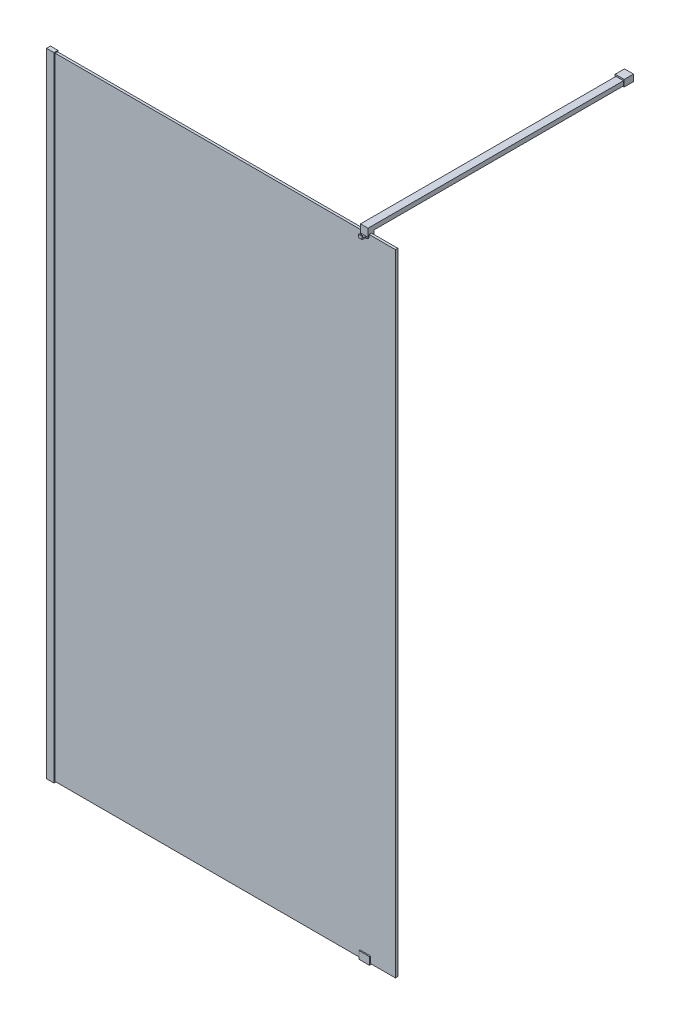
from build123d import *

# Parameters (mm, degrees)
DODANIE_WYCI_GNI_CIE1_DEPTH     = 2100
SZKIC2_W                        = 1147
SZKIC2_H                        = 8
DODANIE_WYCI_GNI_CIE2_DEPTH     = 2100
SZKIC4_W                        = 25
SZKIC4_H                        = 13.3
DODANIE_WYCI_GNI_CIE3_DEPTH     = 3
SZKIC5_W                        = 25
SZKIC5_H                        = 13.3
DODANIE_WYCI_GNI_CIE4_DEPTH     = 3
DODANIE_WYCI_GNI_CIE5_DEPTH     = 17.5
DODANIE_WYCI_GNI_CIE6_DEPTH     = 12.5
WYTNIJ_WYCI_GNI_CIE1_DEPTH      = 2402.039725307
WYTNIJ_WYCI_GNI_CIE1_DEPTH_BACK = 2402.039725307
SZKIC10_W                       = 25
SZKIC10_H                       = 861.63
DODANIE_WYCI_GNI_CIE7_DEPTH     = 15
SZKIC14_W                       = 30
SZKIC14_H                       = 22
DODANIE_WYCI_GNI_CIE8_DEPTH     = 31


with BuildPart() as part:
    # Szkic1 → Dodanie-wyci_gni_cie1 (new body)
    with BuildSketch(Plane(origin=(0, 0, 0), x_dir=(1, 0, 0), z_dir=(0, 1, 0))):
        Polygon((0, 0), (0, 13.3), (25, 13.3), (25, 11.4), (11.45, 11.4), (11.45, 3.4), (25, 3.4), (25, 0), align=None)
    extrude(amount=DODANIE_WYCI_GNI_CIE1_DEPTH)

    # Szkic4 → Dodanie-wyci_gni_cie3 (add)
    with BuildSketch(Plane(origin=(0, 2100, 0), x_dir=(1, 0, 0), z_dir=(0, 1, 0))):
        with Locations((12.5, 6.65)):
            Rectangle(SZKIC4_W, SZKIC4_H)
    extrude(amount=DODANIE_WYCI_GNI_CIE3_DEPTH)

    # Szkic5 → Dodanie-wyci_gni_cie4 (add)
    with BuildSketch(Plane.XZ):
        with Locations((12.5, -6.65)):
            Rectangle(SZKIC5_W, SZKIC5_H)
    extrude(amount=DODANIE_WYCI_GNI_CIE4_DEPTH)


with BuildPart() as body_2:
    # Szkic2 → Dodanie-wyci_gni_cie2 (new body)
    with BuildSketch(Plane.XZ):
        with Locations((584.95, -7.4)):
            Rectangle(SZKIC2_W, SZKIC2_H)
    extrude(amount=-DODANIE_WYCI_GNI_CIE2_DEPTH)


with BuildPart() as body_3:
    # Szkic6 → Dodanie-wyci_gni_cie5 (new, symmetric)
    with BuildSketch(Plane(origin=(1058.45, 0, 0), x_dir=(0, 0, -1), z_dir=(1, 0, 0))):
        Polygon((11.4, 22), (15.75, 22), (15.75, -3), (-0.35, -3), (-0.35, 22), (3.4, 22), (3.4, 0), (11.4, 0), align=None)
    extrude(amount=DODANIE_WYCI_GNI_CIE5_DEPTH, both=True)


with BuildPart() as body_4:
    # Szkic7 → Dodanie-wyci_gni_cie6 (new, symmetric)
    with BuildSketch(Plane(origin=(1058.45, 0, 0), x_dir=(0, 0, -1), z_dir=(1, 0, 0))):
        Polygon((-0.6, 2120), (19.4, 2120), (19.4, 2090), (11.4, 2090), (11.4, 2100), (3.4, 2100), (3.4, 2090), (-13.37, 2090), (-13.37, 2100), (-10.37, 2100), (-9.845068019, 2094), (-0.6, 2094), align=None)
    extrude(amount=DODANIE_WYCI_GNI_CIE6_DEPTH, both=True)

    # Szkic8 → Wytnij-wyci_gni_cie1 (cut, two sides: drawn at the far end of the back side and taken through both)
    with BuildSketch(Plane(origin=(0, 2100, 0), x_dir=(1, 0, 0), z_dir=(0, 1, 0)).offset(-WYTNIJ_WYCI_GNI_CIE1_DEPTH_BACK)):
        Polygon((-904.672203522, 908.990071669), (1045.95, -0.6), (1052.45, -3.630999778), (1052.45, -13.37), (1064.45, -13.37), (1064.45, -3.630999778), (1070.95, -0.6), (3021.572203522, 908.990071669), (3021.572203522, -3395.556863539), (-904.672203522, -3395.556863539), align=None)
    extrude(amount=WYTNIJ_WYCI_GNI_CIE1_DEPTH + WYTNIJ_WYCI_GNI_CIE1_DEPTH_BACK, mode=Mode.SUBTRACT)

    # Szkic10 → Dodanie-wyci_gni_cie7 (add)
    with BuildSketch(Plane(origin=(0, 2120, 0), x_dir=(1, 0, 0), z_dir=(0, 1, 0))):
        with Locations((1058.45, 450.215)):
            Rectangle(SZKIC10_W, SZKIC10_H)
    extrude(amount=-DODANIE_WYCI_GNI_CIE7_DEPTH)

    # Szkic14 → Dodanie-wyci_gni_cie8 (add)
    with BuildSketch(Plane(origin=(0, 0, -881.03), x_dir=(-1, 0, 0), z_dir=(0, 0, -1))):
        with Locations((-1058.45, 2114)):
            Rectangle(SZKIC14_W, SZKIC14_H)
    extrude(amount=-DODANIE_WYCI_GNI_CIE8_DEPTH)


solid = Compound([part.part, body_2.part, body_3.part, body_4.part])
